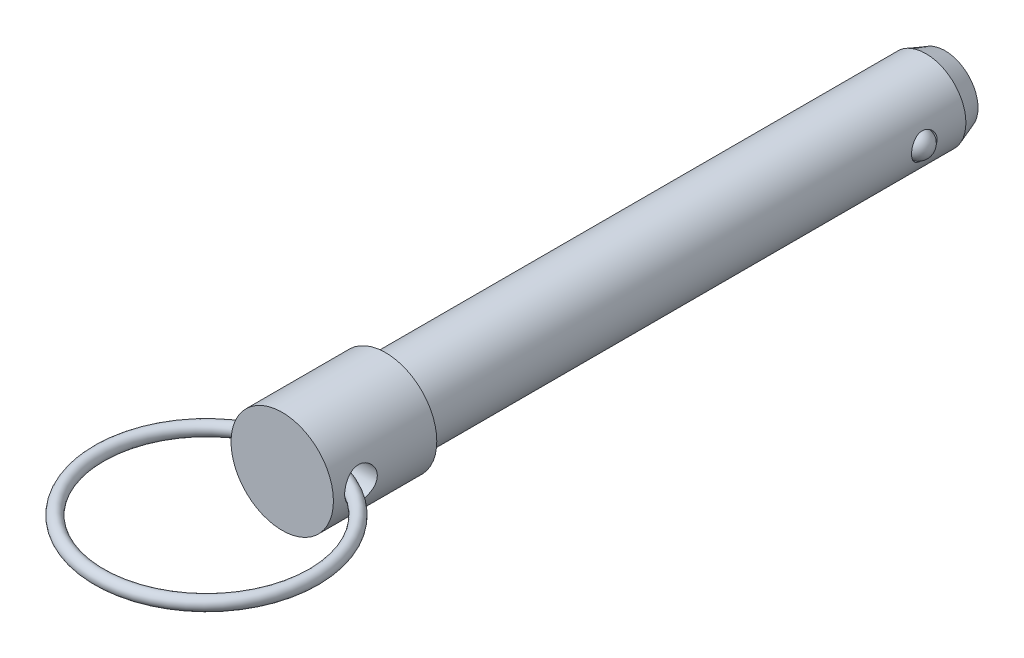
ISO-10303-21;
HEADER;
FILE_DESCRIPTION(('STEP AP214'),'2;1');
FILE_NAME('part.step','',(''),(''),'','','');
FILE_SCHEMA(('AUTOMOTIVE_DESIGN { 1 0 10303 214 1 1 1 1 }'));
ENDSEC;
DATA;
#1=APPLICATION_CONTEXT('core data for automotive mechanical design processes');
#2=APPLICATION_PROTOCOL_DEFINITION('international standard','automotive_design',2000,#1);
#3=PRODUCT_CONTEXT('',#1,'mechanical');
#4=PRODUCT('Part','Part','',(#3));
#5=PRODUCT_RELATED_PRODUCT_CATEGORY('part','',(#4));
#6=PRODUCT_DEFINITION_FORMATION('','',#4);
#7=PRODUCT_DEFINITION_CONTEXT('part definition',#1,'design');
#8=PRODUCT_DEFINITION('design','',#6,#7);
#9=PRODUCT_DEFINITION_SHAPE('','',#8);
#10=(LENGTH_UNIT() NAMED_UNIT(*) SI_UNIT(.MILLI.,.METRE.));
#11=(NAMED_UNIT(*) PLANE_ANGLE_UNIT() SI_UNIT($,.RADIAN.));
#12=(NAMED_UNIT(*) SI_UNIT($,.STERADIAN.) SOLID_ANGLE_UNIT());
#13=UNCERTAINTY_MEASURE_WITH_UNIT(LENGTH_MEASURE(1.E-05),#10,'distance_accuracy_value','');
#14=(GEOMETRIC_REPRESENTATION_CONTEXT(3) GLOBAL_UNCERTAINTY_ASSIGNED_CONTEXT((#13)) GLOBAL_UNIT_ASSIGNED_CONTEXT((#10,
#11,#12)) REPRESENTATION_CONTEXT('',''));
#15=CARTESIAN_POINT('',(0.,0.,0.));
#16=DIRECTION('',(0.,0.,1.));
#17=DIRECTION('',(1.,0.,0.));
#18=AXIS2_PLACEMENT_3D('',#15,#16,#17);
#19=CARTESIAN_POINT('',(7.9375,0.,9.398));
#20=DIRECTION('',(-1.,0.,0.));
#21=DIRECTION('',(0.,0.,-1.));
#22=AXIS2_PLACEMENT_3D('',#19,#20,#21);
#23=CYLINDRICAL_SURFACE('',#22,2.0193);
#24=CARTESIAN_POINT('',(-6.3502,0.292157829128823,11.3960531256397));
#25=CARTESIAN_POINT('',(-6.33446408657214,0.262361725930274,11.4004344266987));
#26=CARTESIAN_POINT('',(-6.32102794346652,0.231225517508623,11.4042829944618));
#27=CARTESIAN_POINT('',(-6.2992523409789,0.167152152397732,11.4106204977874));
#28=CARTESIAN_POINT('',(-6.29090461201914,0.134218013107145,11.413111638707));
#29=CARTESIAN_POINT('',(-6.2797291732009,0.0672091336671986,11.4164621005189));
#30=CARTESIAN_POINT('',(-6.27692077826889,0.0331308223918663,11.4173157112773));
#31=CARTESIAN_POINT('',(-6.27702601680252,-0.0350157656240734,11.4172838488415));
#32=CARTESIAN_POINT('',(-6.27993956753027,-0.0690840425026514,11.4163984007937));
#33=CARTESIAN_POINT('',(-6.29126629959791,-0.135748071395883,11.4130038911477));
#34=CARTESIAN_POINT('',(-6.2996097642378,-0.168356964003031,11.4105154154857));
#35=CARTESIAN_POINT('',(-6.32127848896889,-0.231802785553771,11.404211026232));
#36=CARTESIAN_POINT('',(-6.33461136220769,-0.262636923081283,11.4003930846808));
#37=CARTESIAN_POINT('',(-6.3502,-0.292157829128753,11.3960531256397));
#38=B_SPLINE_CURVE_WITH_KNOTS('',3,(#24,#25,#26,#27,#28,#29,#30,#31,#32,#33,#34,#35,#36,#37),
.UNSPECIFIED.,.F.,.F.,(4,2,2,2,2,2,4),(0.,0.101899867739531,0.203633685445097,0.305721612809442,
0.407808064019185,0.508608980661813,0.609564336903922),.UNSPECIFIED.);
#39=CARTESIAN_POINT('',(-6.3438349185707,0.2797472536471,11.3978284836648));
#40=VERTEX_POINT('',#39);
#41=CARTESIAN_POINT('',(-6.34383491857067,-0.279747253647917,11.3978284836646));
#42=VERTEX_POINT('',#41);
#43=EDGE_CURVE('E40',#40,#42,#38,.T.);
#44=ORIENTED_EDGE('',*,*,#43,.F.);
#45=CARTESIAN_POINT('',(-6.35,0.,11.4173));
#46=CARTESIAN_POINT('',(-6.34999578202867,-0.110312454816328,11.417293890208));
#47=CARTESIAN_POINT('',(-6.34709412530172,-0.220741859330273,11.4082188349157));
#48=CARTESIAN_POINT('',(-6.3357852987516,-0.438477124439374,11.3722159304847));
#49=CARTESIAN_POINT('',(-6.3273687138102,-0.545777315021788,11.3452575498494));
#50=CARTESIAN_POINT('',(-6.30595235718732,-0.753914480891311,11.2744960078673));
#51=CARTESIAN_POINT('',(-6.29296259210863,-0.85476500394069,11.2307296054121));
#52=CARTESIAN_POINT('',(-6.26374009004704,-1.04765917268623,11.1277235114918));
#53=CARTESIAN_POINT('',(-6.24750783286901,-1.13970411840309,11.0684861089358));
#54=CARTESIAN_POINT('',(-6.2129360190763,-1.31536123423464,10.9342184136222));
#55=CARTESIAN_POINT('',(-6.19454917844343,-1.39865352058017,10.8587818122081));
#56=CARTESIAN_POINT('',(-6.15801023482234,-1.55164747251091,10.6951184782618));
#57=CARTESIAN_POINT('',(-6.13985819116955,-1.62134576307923,10.606888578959));
#58=CARTESIAN_POINT('',(-6.1053372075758,-1.74691684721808,10.4173629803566));
#59=CARTESIAN_POINT('',(-6.08902613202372,-1.80238797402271,10.315789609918));
#60=CARTESIAN_POINT('',(-6.06074349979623,-1.89532725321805,10.104153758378));
#61=CARTESIAN_POINT('',(-6.04877073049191,-1.93280043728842,9.99409365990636));
#62=CARTESIAN_POINT('',(-6.03101341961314,-1.9875076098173,9.77220930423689));
#63=CARTESIAN_POINT('',(-6.0250482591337,-2.00533395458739,9.66054596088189));
#64=CARTESIAN_POINT('',(-6.01944581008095,-2.02209234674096,9.43566621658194));
#65=CARTESIAN_POINT('',(-6.01980677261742,-2.02102961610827,9.32245025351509));
#66=CARTESIAN_POINT('',(-6.02665663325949,-2.0005025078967,9.10261826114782));
#67=CARTESIAN_POINT('',(-6.03289303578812,-1.98179631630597,8.99592223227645));
#68=CARTESIAN_POINT('',(-6.05038018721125,-1.92774435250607,8.78726894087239));
#69=CARTESIAN_POINT('',(-6.06163151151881,-1.89239667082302,8.68531222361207));
#70=CARTESIAN_POINT('',(-6.08807105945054,-1.80553890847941,8.48724541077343));
#71=CARTESIAN_POINT('',(-6.1033159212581,-1.75379385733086,8.39124624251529));
#72=CARTESIAN_POINT('',(-6.13599834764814,-1.63577635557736,8.20905256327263));
#73=CARTESIAN_POINT('',(-6.15343637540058,-1.56950083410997,8.12286013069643));
#74=CARTESIAN_POINT('',(-6.18954615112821,-1.42061516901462,7.95845350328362));
#75=CARTESIAN_POINT('',(-6.20823733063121,-1.33738288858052,7.88080597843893));
#76=CARTESIAN_POINT('',(-6.2440320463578,-1.15881168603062,7.74040227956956));
#77=CARTESIAN_POINT('',(-6.26113489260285,-1.06346754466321,7.67765255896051));
#78=CARTESIAN_POINT('',(-6.29201953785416,-0.862230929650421,7.56842117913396));
#79=CARTESIAN_POINT('',(-6.30576997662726,-0.756251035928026,7.5220914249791));
#80=CARTESIAN_POINT('',(-6.32815272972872,-0.537579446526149,7.448167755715));
#81=CARTESIAN_POINT('',(-6.3367955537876,-0.42490206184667,7.4205353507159));
#82=CARTESIAN_POINT('',(-6.34491251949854,-0.259333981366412,7.39474486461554));
#83=CARTESIAN_POINT('',(-6.3468148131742,-0.207677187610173,7.38873516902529));
#84=CARTESIAN_POINT('',(-6.34935954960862,-0.104022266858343,7.38071129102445));
#85=CARTESIAN_POINT('',(-6.35000198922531,-0.0520241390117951,7.37869711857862));
#86=CARTESIAN_POINT('',(-6.34999578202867,0.110312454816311,7.37870610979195));
#87=CARTESIAN_POINT('',(-6.34709412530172,0.220741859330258,7.38778116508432));
#88=CARTESIAN_POINT('',(-6.33578529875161,0.438477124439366,7.4237840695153));
#89=CARTESIAN_POINT('',(-6.32736871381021,0.545777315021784,7.45074245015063));
#90=CARTESIAN_POINT('',(-6.30595235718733,0.753914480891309,7.52150399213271));
#91=CARTESIAN_POINT('',(-6.29296259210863,0.854765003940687,7.56527039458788));
#92=CARTESIAN_POINT('',(-6.26374009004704,1.04765917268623,7.66827648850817));
#93=CARTESIAN_POINT('',(-6.24750783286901,1.13970411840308,7.72751389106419));
#94=CARTESIAN_POINT('',(-6.2129360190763,1.31536123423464,7.86178158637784));
#95=CARTESIAN_POINT('',(-6.19454917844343,1.39865352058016,7.93721818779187));
#96=CARTESIAN_POINT('',(-6.15801023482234,1.55164747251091,8.10088152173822));
#97=CARTESIAN_POINT('',(-6.13985819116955,1.62134576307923,8.18911142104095));
#98=CARTESIAN_POINT('',(-6.1053372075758,1.74691684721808,8.37863701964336));
#99=CARTESIAN_POINT('',(-6.08902613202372,1.80238797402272,8.48021039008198));
#100=CARTESIAN_POINT('',(-6.06074349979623,1.89532725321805,8.69184624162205));
#101=CARTESIAN_POINT('',(-6.04877073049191,1.93280043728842,8.80190634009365));
#102=CARTESIAN_POINT('',(-6.03101341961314,1.9875076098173,9.02379069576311));
#103=CARTESIAN_POINT('',(-6.0250482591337,2.00533395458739,9.13545403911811));
#104=CARTESIAN_POINT('',(-6.01944581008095,2.02209234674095,9.36033378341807));
#105=CARTESIAN_POINT('',(-6.01980677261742,2.02102961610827,9.47354974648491));
#106=CARTESIAN_POINT('',(-6.02665663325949,2.00050250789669,9.69338173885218));
#107=CARTESIAN_POINT('',(-6.03289303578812,1.98179631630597,9.80007776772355));
#108=CARTESIAN_POINT('',(-6.05038018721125,1.92774435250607,10.0087310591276));
#109=CARTESIAN_POINT('',(-6.06163151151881,1.89239667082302,10.1106877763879));
#110=CARTESIAN_POINT('',(-6.08807105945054,1.80553890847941,10.3087545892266));
#111=CARTESIAN_POINT('',(-6.1033159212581,1.75379385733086,10.4047537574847));
#112=CARTESIAN_POINT('',(-6.13599834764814,1.63577635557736,10.5869474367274));
#113=CARTESIAN_POINT('',(-6.15343637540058,1.56950083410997,10.6731398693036));
#114=CARTESIAN_POINT('',(-6.18954615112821,1.42061516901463,10.8375464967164));
#115=CARTESIAN_POINT('',(-6.20823733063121,1.33738288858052,10.9151940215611));
#116=CARTESIAN_POINT('',(-6.2440320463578,1.15881168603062,11.0555977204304));
#117=CARTESIAN_POINT('',(-6.26113489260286,1.06346754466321,11.1183474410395));
#118=CARTESIAN_POINT('',(-6.29201953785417,0.862230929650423,11.227578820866));
#119=CARTESIAN_POINT('',(-6.30576997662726,0.756251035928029,11.2739085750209));
#120=CARTESIAN_POINT('',(-6.32815272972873,0.53757944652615,11.347832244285));
#121=CARTESIAN_POINT('',(-6.33679555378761,0.424902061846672,11.3754646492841));
#122=CARTESIAN_POINT('',(-6.34491251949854,0.25933398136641,11.4012551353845));
#123=CARTESIAN_POINT('',(-6.34681481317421,0.207677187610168,11.4072648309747));
#124=CARTESIAN_POINT('',(-6.34935954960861,0.10402226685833,11.4152887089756));
#125=CARTESIAN_POINT('',(-6.35000198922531,0.0520241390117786,11.4173028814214));
#126=CARTESIAN_POINT('',(-6.35,0.,11.4173));
#127=B_SPLINE_CURVE_WITH_KNOTS('',3,(#45,#46,#47,#48,#49,#50,#51,#52,#53,#54,#55,#56,#57,#58,
#59,#60,#61,#62,#63,#64,#65,#66,#67,#68,#69,#70,#71,#72,#73,#74,#75,#76,#77,#78,#79,#80,#81,#82,
#83,#84,#85,#86,#87,#88,#89,#90,#91,#92,#93,#94,#95,#96,#97,#98,#99,#100,#101,#102,#103,#104,
#105,#106,#107,#108,#109,#110,#111,#112,#113,#114,#115,#116,#117,#118,#119,#120,#121,#122,#123,
#124,#125,#126),.UNSPECIFIED.,.T.,.F.,(4,2,2,2,2,2,2,2,2,2,2,2,2,2,2,2,2,2,2,2,2,2,2,2,2,2,2,2,
2,2,2,2,2,2,2,2,2,2,2,2,4),(0.,0.33073688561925,0.662039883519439,0.992622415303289,
1.32315606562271,1.66322530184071,2.00337886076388,2.35228054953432,2.70108463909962,
3.0390572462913,3.37693642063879,3.70092724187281,4.02495524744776,4.35385413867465,
4.68282260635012,5.02727904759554,5.37188442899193,5.71959937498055,6.06659632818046,
6.22257380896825,6.37855167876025,6.70928856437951,7.04059156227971,7.37117409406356,
7.70170774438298,8.04177698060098,8.38193053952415,8.73083222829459,9.0796363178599,
9.41760892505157,9.75548809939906,10.0794789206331,10.403506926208,10.7324058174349,
11.0613742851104,11.4058307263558,11.7504361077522,12.0981510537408,12.4451480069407,
12.6011254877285,12.7571033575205),.UNSPECIFIED.);
#128=EDGE_CURVE('E66',#42,#40,#127,.T.);
#129=ORIENTED_EDGE('',*,*,#128,.F.);
#130=EDGE_LOOP('',(#44,#129));
#131=FACE_BOUND('',#130,.T.);
#132=CARTESIAN_POINT('',(6.3502,-0.292157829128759,11.3960531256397));
#133=CARTESIAN_POINT('',(6.33446408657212,-0.262361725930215,11.4004344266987));
#134=CARTESIAN_POINT('',(6.32102794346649,-0.231225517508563,11.4042829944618));
#135=CARTESIAN_POINT('',(6.29925234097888,-0.167152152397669,11.4106204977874));
#136=CARTESIAN_POINT('',(6.29090461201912,-0.13421801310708,11.413111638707));
#137=CARTESIAN_POINT('',(6.27972917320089,-0.0672091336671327,11.4164621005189));
#138=CARTESIAN_POINT('',(6.27692077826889,-0.0331308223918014,11.4173157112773));
#139=CARTESIAN_POINT('',(6.27702601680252,0.0350157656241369,11.4172838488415));
#140=CARTESIAN_POINT('',(6.27993956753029,0.0690840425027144,11.4163984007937));
#141=CARTESIAN_POINT('',(6.29126629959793,0.135748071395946,11.4130038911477));
#142=CARTESIAN_POINT('',(6.29960976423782,0.168356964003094,11.4105154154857));
#143=CARTESIAN_POINT('',(6.3212784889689,0.231802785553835,11.4042110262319));
#144=CARTESIAN_POINT('',(6.3346113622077,0.262636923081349,11.4003930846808));
#145=CARTESIAN_POINT('',(6.3502,0.292157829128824,11.3960531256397));
#146=B_SPLINE_CURVE_WITH_KNOTS('',3,(#132,#133,#134,#135,#136,#137,#138,#139,#140,#141,#142,
#143,#144,#145),.UNSPECIFIED.,.F.,.F.,(4,2,2,2,2,2,4),(0.,0.101899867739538,0.203633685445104,
0.305721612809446,0.40780806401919,0.508608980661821,0.609564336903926),.UNSPECIFIED.);
#147=CARTESIAN_POINT('',(6.3438349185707,-0.279747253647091,11.3978284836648));
#148=VERTEX_POINT('',#147);
#149=CARTESIAN_POINT('',(6.34383491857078,0.279747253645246,11.397828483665));
#150=VERTEX_POINT('',#149);
#151=EDGE_CURVE('E33',#148,#150,#146,.T.);
#152=ORIENTED_EDGE('',*,*,#151,.F.);
#153=CARTESIAN_POINT('',(6.35,0.,7.3787));
#154=CARTESIAN_POINT('',(6.34999578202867,-0.110312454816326,7.37870610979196));
#155=CARTESIAN_POINT('',(6.34709412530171,-0.22074185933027,7.38778116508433));
#156=CARTESIAN_POINT('',(6.3357852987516,-0.438477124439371,7.4237840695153));
#157=CARTESIAN_POINT('',(6.32736871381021,-0.545777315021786,7.45074245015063));
#158=CARTESIAN_POINT('',(6.30595235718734,-0.753914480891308,7.52150399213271));
#159=CARTESIAN_POINT('',(6.29296259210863,-0.854765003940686,7.56527039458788));
#160=CARTESIAN_POINT('',(6.26374009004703,-1.04765917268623,7.66827648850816));
#161=CARTESIAN_POINT('',(6.247507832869,-1.13970411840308,7.72751389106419));
#162=CARTESIAN_POINT('',(6.21293601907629,-1.31536123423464,7.86178158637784));
#163=CARTESIAN_POINT('',(6.19454917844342,-1.39865352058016,7.93721818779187));
#164=CARTESIAN_POINT('',(6.15801023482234,-1.55164747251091,8.10088152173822));
#165=CARTESIAN_POINT('',(6.13985819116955,-1.62134576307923,8.18911142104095));
#166=CARTESIAN_POINT('',(6.1053372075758,-1.74691684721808,8.37863701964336));
#167=CARTESIAN_POINT('',(6.08902613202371,-1.80238797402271,8.48021039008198));
#168=CARTESIAN_POINT('',(6.06074349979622,-1.89532725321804,8.69184624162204));
#169=CARTESIAN_POINT('',(6.04877073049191,-1.93280043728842,8.80190634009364));
#170=CARTESIAN_POINT('',(6.03101341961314,-1.9875076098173,9.02379069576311));
#171=CARTESIAN_POINT('',(6.02504825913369,-2.00533395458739,9.13545403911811));
#172=CARTESIAN_POINT('',(6.01944581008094,-2.02209234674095,9.36033378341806));
#173=CARTESIAN_POINT('',(6.01980677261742,-2.02102961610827,9.47354974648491));
#174=CARTESIAN_POINT('',(6.02665663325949,-2.00050250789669,9.69338173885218));
#175=CARTESIAN_POINT('',(6.03289303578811,-1.98179631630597,9.80007776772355));
#176=CARTESIAN_POINT('',(6.05038018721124,-1.92774435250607,10.0087310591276));
#177=CARTESIAN_POINT('',(6.06163151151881,-1.89239667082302,10.1106877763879));
#178=CARTESIAN_POINT('',(6.08807105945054,-1.80553890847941,10.3087545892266));
#179=CARTESIAN_POINT('',(6.1033159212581,-1.75379385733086,10.4047537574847));
#180=CARTESIAN_POINT('',(6.13599834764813,-1.63577635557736,10.5869474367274));
#181=CARTESIAN_POINT('',(6.15343637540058,-1.56950083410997,10.6731398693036));
#182=CARTESIAN_POINT('',(6.18954615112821,-1.42061516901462,10.8375464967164));
#183=CARTESIAN_POINT('',(6.2082373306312,-1.33738288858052,10.9151940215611));
#184=CARTESIAN_POINT('',(6.24403204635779,-1.15881168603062,11.0555977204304));
#185=CARTESIAN_POINT('',(6.26113489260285,-1.06346754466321,11.1183474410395));
#186=CARTESIAN_POINT('',(6.29201953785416,-0.862230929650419,11.227578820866));
#187=CARTESIAN_POINT('',(6.30576997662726,-0.756251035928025,11.2739085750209));
#188=CARTESIAN_POINT('',(6.32815272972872,-0.537579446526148,11.347832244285));
#189=CARTESIAN_POINT('',(6.3367955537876,-0.424902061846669,11.3754646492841));
#190=CARTESIAN_POINT('',(6.34491251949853,-0.25933398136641,11.4012551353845));
#191=CARTESIAN_POINT('',(6.3468148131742,-0.207677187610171,11.4072648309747));
#192=CARTESIAN_POINT('',(6.34935954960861,-0.10402226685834,11.4152887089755));
#193=CARTESIAN_POINT('',(6.35000198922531,-0.0520241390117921,11.4173028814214));
#194=CARTESIAN_POINT('',(6.34999578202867,0.110312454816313,11.417293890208));
#195=CARTESIAN_POINT('',(6.34709412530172,0.220741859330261,11.4082188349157));
#196=CARTESIAN_POINT('',(6.33578529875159,0.438477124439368,11.3722159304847));
#197=CARTESIAN_POINT('',(6.3273687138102,0.545777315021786,11.3452575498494));
#198=CARTESIAN_POINT('',(6.30595235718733,0.753914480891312,11.2744960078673));
#199=CARTESIAN_POINT('',(6.29296259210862,0.854765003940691,11.2307296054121));
#200=CARTESIAN_POINT('',(6.26374009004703,1.04765917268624,11.1277235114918));
#201=CARTESIAN_POINT('',(6.247507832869,1.13970411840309,11.0684861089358));
#202=CARTESIAN_POINT('',(6.21293601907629,1.31536123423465,10.9342184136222));
#203=CARTESIAN_POINT('',(6.19454917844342,1.39865352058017,10.8587818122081));
#204=CARTESIAN_POINT('',(6.15801023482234,1.55164747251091,10.6951184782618));
#205=CARTESIAN_POINT('',(6.13985819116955,1.62134576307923,10.606888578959));
#206=CARTESIAN_POINT('',(6.1053372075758,1.74691684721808,10.4173629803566));
#207=CARTESIAN_POINT('',(6.08902613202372,1.80238797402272,10.315789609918));
#208=CARTESIAN_POINT('',(6.06074349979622,1.89532725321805,10.104153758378));
#209=CARTESIAN_POINT('',(6.0487707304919,1.93280043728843,9.99409365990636));
#210=CARTESIAN_POINT('',(6.03101341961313,1.9875076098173,9.77220930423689));
#211=CARTESIAN_POINT('',(6.02504825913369,2.0053339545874,9.66054596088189));
#212=CARTESIAN_POINT('',(6.01944581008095,2.02209234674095,9.43566621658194));
#213=CARTESIAN_POINT('',(6.01980677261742,2.02102961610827,9.32245025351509));
#214=CARTESIAN_POINT('',(6.02665663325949,2.00050250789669,9.10261826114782));
#215=CARTESIAN_POINT('',(6.03289303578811,1.98179631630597,8.99592223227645));
#216=CARTESIAN_POINT('',(6.05038018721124,1.92774435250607,8.78726894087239));
#217=CARTESIAN_POINT('',(6.06163151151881,1.89239667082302,8.68531222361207));
#218=CARTESIAN_POINT('',(6.08807105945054,1.80553890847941,8.48724541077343));
#219=CARTESIAN_POINT('',(6.1033159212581,1.75379385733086,8.39124624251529));
#220=CARTESIAN_POINT('',(6.13599834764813,1.63577635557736,8.20905256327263));
#221=CARTESIAN_POINT('',(6.15343637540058,1.56950083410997,8.12286013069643));
#222=CARTESIAN_POINT('',(6.18954615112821,1.42061516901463,7.95845350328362));
#223=CARTESIAN_POINT('',(6.2082373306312,1.33738288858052,7.88080597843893));
#224=CARTESIAN_POINT('',(6.24403204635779,1.15881168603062,7.74040227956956));
#225=CARTESIAN_POINT('',(6.26113489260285,1.06346754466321,7.67765255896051));
#226=CARTESIAN_POINT('',(6.29201953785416,0.862230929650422,7.56842117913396));
#227=CARTESIAN_POINT('',(6.30576997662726,0.756251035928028,7.5220914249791));
#228=CARTESIAN_POINT('',(6.32815272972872,0.53757944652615,7.448167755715));
#229=CARTESIAN_POINT('',(6.3367955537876,0.424902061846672,7.4205353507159));
#230=CARTESIAN_POINT('',(6.34491251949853,0.25933398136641,7.39474486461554));
#231=CARTESIAN_POINT('',(6.3468148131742,0.207677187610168,7.38873516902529));
#232=CARTESIAN_POINT('',(6.34935954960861,0.104022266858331,7.38071129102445));
#233=CARTESIAN_POINT('',(6.35000198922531,0.0520241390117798,7.37869711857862));
#234=CARTESIAN_POINT('',(6.35,0.,7.3787));
#235=B_SPLINE_CURVE_WITH_KNOTS('',3,(#153,#154,#155,#156,#157,#158,#159,#160,#161,#162,#163,
#164,#165,#166,#167,#168,#169,#170,#171,#172,#173,#174,#175,#176,#177,#178,#179,#180,#181,#182,
#183,#184,#185,#186,#187,#188,#189,#190,#191,#192,#193,#194,#195,#196,#197,#198,#199,#200,#201,
#202,#203,#204,#205,#206,#207,#208,#209,#210,#211,#212,#213,#214,#215,#216,#217,#218,#219,#220,
#221,#222,#223,#224,#225,#226,#227,#228,#229,#230,#231,#232,#233,#234),.UNSPECIFIED.,.T.,.F.,(4,
2,2,2,2,2,2,2,2,2,2,2,2,2,2,2,2,2,2,2,2,2,2,2,2,2,2,2,2,2,2,2,2,2,2,2,2,2,2,2,4),(0.,
0.330736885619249,0.662039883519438,0.992622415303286,1.32315606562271,1.66322530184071,
2.00337886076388,2.35228054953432,2.70108463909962,3.0390572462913,3.37693642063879,
3.7009272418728,4.02495524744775,4.35385413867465,4.68282260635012,5.02727904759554,
5.37188442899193,5.71959937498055,6.06659632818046,6.22257380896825,6.37855167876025,
6.70928856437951,7.04059156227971,7.37117409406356,7.70170774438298,8.04177698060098,
8.38193053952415,8.73083222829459,9.07963631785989,9.41760892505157,9.75548809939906,
10.0794789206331,10.403506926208,10.7324058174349,11.0613742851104,11.4058307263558,
11.7504361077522,12.0981510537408,12.4451480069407,12.6011254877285,12.7571033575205),.UNSPECIFIED.);
#236=EDGE_CURVE('E62',#150,#148,#235,.T.);
#237=ORIENTED_EDGE('',*,*,#236,.F.);
#238=EDGE_LOOP('',(#152,#237));
#239=FACE_BOUND('',#238,.T.);
#240=ADVANCED_FACE('F14',(#131,#239),#23,.F.);
#241=CARTESIAN_POINT('',(0.,0.,-34.39922));
#242=DIRECTION('',(0.,0.,-1.));
#243=DIRECTION('',(1.,0.,0.));
#244=AXIS2_PLACEMENT_3D('',#241,#242,#243);
#245=CYLINDRICAL_SURFACE('',#244,6.35);
#246=ORIENTED_EDGE('',*,*,#236,.T.);
#247=CARTESIAN_POINT('',(6.34911067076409,-0.106292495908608,9.64531337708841));
#248=CARTESIAN_POINT('',(6.3483941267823,-0.149074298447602,9.65137725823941));
#249=CARTESIAN_POINT('',(6.34724965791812,-0.191344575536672,9.66110939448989));
#250=CARTESIAN_POINT('',(6.34423605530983,-0.273618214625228,9.68758101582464));
#251=CARTESIAN_POINT('',(6.34236646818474,-0.3136201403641,9.704324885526));
#252=CARTESIAN_POINT('',(6.3381174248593,-0.39017545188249,9.74421775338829));
#253=CARTESIAN_POINT('',(6.33573876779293,-0.42673411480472,9.76735672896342));
#254=CARTESIAN_POINT('',(6.33072830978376,-0.495552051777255,9.8192835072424));
#255=CARTESIAN_POINT('',(6.32809652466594,-0.527811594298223,9.84807095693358));
#256=CARTESIAN_POINT('',(6.32277775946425,-0.588154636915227,9.91124388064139));
#257=CARTESIAN_POINT('',(6.32009122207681,-0.616100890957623,9.94576018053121));
#258=CARTESIAN_POINT('',(6.31500218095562,-0.666246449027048,10.0187508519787));
#259=CARTESIAN_POINT('',(6.31259974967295,-0.688444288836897,10.0572262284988));
#260=CARTESIAN_POINT('',(6.30814194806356,-0.728200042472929,10.1398945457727));
#261=CARTESIAN_POINT('',(6.30612298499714,-0.745320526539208,10.1842993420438));
#262=CARTESIAN_POINT('',(6.30283333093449,-0.772645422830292,10.2752074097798));
#263=CARTESIAN_POINT('',(6.30156294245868,-0.782847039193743,10.3217115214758));
#264=CARTESIAN_POINT('',(6.2997729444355,-0.797132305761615,10.4203656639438));
#265=CARTESIAN_POINT('',(6.29934001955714,-0.800511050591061,10.4726191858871));
#266=CARTESIAN_POINT('',(6.29948539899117,-0.799363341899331,10.5770343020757));
#267=CARTESIAN_POINT('',(6.30006412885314,-0.79483356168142,10.6291958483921));
#268=CARTESIAN_POINT('',(6.30224519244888,-0.777362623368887,10.7373900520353));
#269=CARTESIAN_POINT('',(6.30394321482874,-0.763632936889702,10.7932945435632));
#270=CARTESIAN_POINT('',(6.3082304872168,-0.727364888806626,10.9021925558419));
#271=CARTESIAN_POINT('',(6.31082057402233,-0.704818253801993,10.9551832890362));
#272=CARTESIAN_POINT('',(6.31668084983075,-0.65024958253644,11.058462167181));
#273=CARTESIAN_POINT('',(6.31997188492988,-0.617920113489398,11.108588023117));
#274=CARTESIAN_POINT('',(6.32672369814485,-0.54444422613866,11.2018715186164));
#275=CARTESIAN_POINT('',(6.33018413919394,-0.503314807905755,11.2450423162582));
#276=CARTESIAN_POINT('',(6.33576833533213,-0.426106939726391,11.3105875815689));
#277=CARTESIAN_POINT('',(6.3379874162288,-0.392058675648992,11.3353540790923));
#278=CARTESIAN_POINT('',(6.34201635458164,-0.320334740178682,11.378985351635));
#279=CARTESIAN_POINT('',(6.34382654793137,-0.282662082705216,11.3978549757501));
#280=CARTESIAN_POINT('',(6.34683709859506,-0.204222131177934,11.4286907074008));
#281=CARTESIAN_POINT('',(6.34803303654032,-0.16343477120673,11.4406068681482));
#282=CARTESIAN_POINT('',(6.34962760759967,-0.0803154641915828,11.456409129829));
#283=CARTESIAN_POINT('',(6.35002678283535,-0.0379845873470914,11.4603006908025));
#284=CARTESIAN_POINT('',(6.34997361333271,0.0416311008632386,11.4597766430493));
#285=CARTESIAN_POINT('',(6.34961570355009,0.0789250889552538,11.4562823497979));
#286=CARTESIAN_POINT('',(6.34827799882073,0.152365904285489,11.4430416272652));
#287=CARTESIAN_POINT('',(6.34729819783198,0.188512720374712,11.4332951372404));
#288=CARTESIAN_POINT('',(6.34483463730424,0.258437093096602,11.4082426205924));
#289=CARTESIAN_POINT('',(6.34335520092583,0.292232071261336,11.392984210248));
#290=CARTESIAN_POINT('',(6.3400309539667,0.357164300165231,11.3576448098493));
#291=CARTESIAN_POINT('',(6.33818602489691,0.388300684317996,11.3375622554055));
#292=CARTESIAN_POINT('',(6.33403341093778,0.451264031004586,11.2905464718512));
#293=CARTESIAN_POINT('',(6.33169671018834,0.482680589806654,11.2630681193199));
#294=CARTESIAN_POINT('',(6.32695276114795,0.541327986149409,11.2039742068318));
#295=CARTESIAN_POINT('',(6.32454547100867,0.568556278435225,11.1723561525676));
#296=CARTESIAN_POINT('',(6.31940966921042,0.623257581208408,11.0997303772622));
#297=CARTESIAN_POINT('',(6.31670324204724,0.649859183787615,11.0580641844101));
#298=CARTESIAN_POINT('',(6.31169900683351,0.696787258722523,10.9713122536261));
#299=CARTESIAN_POINT('',(6.30940147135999,0.717109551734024,10.9262242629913));
#300=CARTESIAN_POINT('',(6.30511939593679,0.753900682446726,10.8265682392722));
#301=CARTESIAN_POINT('',(6.30323580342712,0.769311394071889,10.7716021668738));
#302=CARTESIAN_POINT('',(6.30052520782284,0.791204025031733,10.6598731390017));
#303=CARTESIAN_POINT('',(6.2996986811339,0.797681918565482,10.6031093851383));
#304=CARTESIAN_POINT('',(6.29923241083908,0.801360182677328,10.4867557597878));
#305=CARTESIAN_POINT('',(6.2996462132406,0.798141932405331,10.4271509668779));
#306=CARTESIAN_POINT('',(6.30178827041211,0.781050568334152,10.3094933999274));
#307=CARTESIAN_POINT('',(6.30351599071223,0.767181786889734,10.2514400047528));
#308=CARTESIAN_POINT('',(6.30793273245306,0.7299366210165,10.1430301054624));
#309=CARTESIAN_POINT('',(6.31054579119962,0.707295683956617,10.0924193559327));
#310=CARTESIAN_POINT('',(6.316412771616,0.652821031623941,9.99644731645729));
#311=CARTESIAN_POINT('',(6.31966615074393,0.620995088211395,9.95108163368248));
#312=CARTESIAN_POINT('',(6.3259599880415,0.55295430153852,9.87232840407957));
#313=CARTESIAN_POINT('',(6.32898344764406,0.517631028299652,9.83816824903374));
#314=CARTESIAN_POINT('',(6.33476504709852,0.441261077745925,9.77694761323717));
#315=CARTESIAN_POINT('',(6.33752330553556,0.400216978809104,9.74988394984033));
#316=CARTESIAN_POINT('',(6.34218417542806,0.317440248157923,9.70596453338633));
#317=CARTESIAN_POINT('',(6.34413984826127,0.276067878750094,9.68843287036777));
#318=CARTESIAN_POINT('',(6.34727291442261,0.190881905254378,9.66089843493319));
#319=CARTESIAN_POINT('',(6.34845102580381,0.147070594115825,9.65088871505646));
#320=CARTESIAN_POINT('',(6.34972965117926,0.0681015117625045,9.64007587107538));
#321=CARTESIAN_POINT('',(6.35000959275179,0.0331486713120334,9.63773711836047));
#322=CARTESIAN_POINT('',(6.34998989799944,-0.0367451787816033,9.63790342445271));
#323=CARTESIAN_POINT('',(6.34969028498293,-0.0716861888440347,9.64040828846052));
#324=CARTESIAN_POINT('',(6.34911067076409,-0.106292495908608,9.64531337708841));
#325=B_SPLINE_CURVE_WITH_KNOTS('',3,(#247,#248,#249,#250,#251,#252,#253,#254,#255,#256,#257,
#258,#259,#260,#261,#262,#263,#264,#265,#266,#267,#268,#269,#270,#271,#272,#273,#274,#275,#276,
#277,#278,#279,#280,#281,#282,#283,#284,#285,#286,#287,#288,#289,#290,#291,#292,#293,#294,#295,
#296,#297,#298,#299,#300,#301,#302,#303,#304,#305,#306,#307,#308,#309,#310,#311,#312,#313,#314,
#315,#316,#317,#318,#319,#320,#321,#322,#323,#324),.UNSPECIFIED.,.T.,.F.,(4,2,2,2,2,2,2,2,2,2,2,
2,2,2,2,2,2,2,2,2,2,2,2,2,2,2,2,2,2,2,2,2,2,2,2,2,2,2,4),(0.,0.129515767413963,
0.259112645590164,0.388507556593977,0.517894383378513,0.650795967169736,0.783731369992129,
0.926038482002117,1.06840306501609,1.22484845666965,1.38135967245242,1.55336962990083,
1.72554138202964,1.90381365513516,2.08174459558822,2.2077364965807,2.33362451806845,
2.4604060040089,2.58710119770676,2.6989276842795,2.81075525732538,2.92163901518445,
3.03255877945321,3.15750232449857,3.28252150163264,3.43047497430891,3.57852670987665,
3.74912471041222,3.91979957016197,4.09794717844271,4.27602235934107,4.44160182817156,
4.60704160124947,4.75394079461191,4.90077399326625,5.03502725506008,5.1691563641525,
5.27392620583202,5.37869183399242),.UNSPECIFIED.);
#326=EDGE_CURVE('E27',#148,#150,#325,.T.);
#327=ORIENTED_EDGE('',*,*,#326,.T.);
#328=EDGE_LOOP('',(#246,#327));
#329=FACE_BOUND('',#328,.T.);
#330=CARTESIAN_POINT('',(0.,0.,12.8270000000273));
#331=DIRECTION('',(0.,0.,-1.));
#332=DIRECTION('',(1.,0.,0.));
#333=AXIS2_PLACEMENT_3D('',#330,#331,#332);
#334=CIRCLE('',#333,6.34999999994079);
#335=CARTESIAN_POINT('',(6.34999999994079,0.,12.8270000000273));
#336=VERTEX_POINT('',#335);
#337=EDGE_CURVE('E70',#336,#336,#334,.T.);
#338=ORIENTED_EDGE('',*,*,#337,.T.);
#339=EDGE_LOOP('',(#338));
#340=FACE_BOUND('',#339,.T.);
#341=CARTESIAN_POINT('',(0.,0.,1.16018306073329E-11));
#342=DIRECTION('',(0.,0.,-1.));
#343=DIRECTION('',(1.,0.,0.));
#344=AXIS2_PLACEMENT_3D('',#341,#342,#343);
#345=CIRCLE('',#344,6.34999999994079);
#346=CARTESIAN_POINT('',(6.34999999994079,0.,1.16015507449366E-11));
#347=VERTEX_POINT('',#346);
#348=EDGE_CURVE('E60',#347,#347,#345,.T.);
#349=ORIENTED_EDGE('',*,*,#348,.F.);
#350=EDGE_LOOP('',(#349));
#351=FACE_BOUND('',#350,.T.);
#352=ORIENTED_EDGE('',*,*,#128,.T.);
#353=CARTESIAN_POINT('',(-6.3491106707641,-0.106292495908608,9.64531337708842));
#354=CARTESIAN_POINT('',(-6.34981427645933,-0.0642492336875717,9.63935614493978));
#355=CARTESIAN_POINT('',(-6.35010491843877,-0.0216882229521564,9.63693832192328));
#356=CARTESIAN_POINT('',(-6.34982708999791,0.0632451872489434,9.63926820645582));
#357=CARTESIAN_POINT('',(-6.34925830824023,0.105617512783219,9.64401851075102));
#358=CARTESIAN_POINT('',(-6.3473255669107,0.188929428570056,9.66052387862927));
#359=CARTESIAN_POINT('',(-6.34596206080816,0.22986982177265,9.67227494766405));
#360=CARTESIAN_POINT('',(-6.34259173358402,0.309205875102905,9.7023861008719));
#361=CARTESIAN_POINT('',(-6.34058494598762,0.347601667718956,9.72074584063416));
#362=CARTESIAN_POINT('',(-6.33612262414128,0.421219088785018,9.76368889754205));
#363=CARTESIAN_POINT('',(-6.33366281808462,0.456405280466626,9.78833239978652));
#364=CARTESIAN_POINT('',(-6.3285674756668,0.522330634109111,9.84295801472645));
#365=CARTESIAN_POINT('',(-6.32593191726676,0.553069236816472,9.87294079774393));
#366=CARTESIAN_POINT('',(-6.32063739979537,0.610668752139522,9.93869049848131));
#367=CARTESIAN_POINT('',(-6.31798210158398,0.637312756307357,9.97464737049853));
#368=CARTESIAN_POINT('',(-6.31302530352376,0.684675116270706,10.050284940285));
#369=CARTESIAN_POINT('',(-6.31072390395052,0.705391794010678,10.0899666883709));
#370=CARTESIAN_POINT('',(-6.3065253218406,0.742027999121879,10.1750481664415));
#371=CARTESIAN_POINT('',(-6.30467116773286,0.757473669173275,10.2206536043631));
#372=CARTESIAN_POINT('',(-6.30176158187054,0.781309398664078,10.3136897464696));
#373=CARTESIAN_POINT('',(-6.30070647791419,0.789696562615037,10.3611211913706));
#374=CARTESIAN_POINT('',(-6.29939708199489,0.800080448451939,10.4615517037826));
#375=CARTESIAN_POINT('',(-6.29923479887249,0.80134327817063,10.5146278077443));
#376=CARTESIAN_POINT('',(-6.29993274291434,0.795834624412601,10.6203535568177));
#377=CARTESIAN_POINT('',(-6.30079341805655,0.789059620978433,10.6730030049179));
#378=CARTESIAN_POINT('',(-6.30354435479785,0.76679085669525,10.7816321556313));
#379=CARTESIAN_POINT('',(-6.3055245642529,0.75053077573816,10.8374538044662));
#380=CARTESIAN_POINT('',(-6.3103170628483,0.709106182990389,10.9457204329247));
#381=CARTESIAN_POINT('',(-6.31313013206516,0.683933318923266,10.9981621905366));
#382=CARTESIAN_POINT('',(-6.31930287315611,0.624362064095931,11.0989766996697));
#383=CARTESIAN_POINT('',(-6.32267249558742,0.589786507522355,11.1472450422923));
#384=CARTESIAN_POINT('',(-6.32944316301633,0.512016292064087,11.2362287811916));
#385=CARTESIAN_POINT('',(-6.33284412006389,0.468841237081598,11.2769609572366));
#386=CARTESIAN_POINT('',(-6.3381447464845,0.389210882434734,11.3371705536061));
#387=CARTESIAN_POINT('',(-6.34018413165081,0.354783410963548,11.3593300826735));
#388=CARTESIAN_POINT('',(-6.34380499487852,0.282727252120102,11.3976985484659));
#389=CARTESIAN_POINT('',(-6.34538687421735,0.245101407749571,11.4139127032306));
#390=CARTESIAN_POINT('',(-6.34791613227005,0.16728046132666,11.4394899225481));
#391=CARTESIAN_POINT('',(-6.34885950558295,0.127070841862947,11.4488097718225));
#392=CARTESIAN_POINT('',(-6.34996657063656,0.0456031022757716,11.459723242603));
#393=CARTESIAN_POINT('',(-6.35013061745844,0.00434546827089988,11.4613203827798));
#394=CARTESIAN_POINT('',(-6.34968170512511,-0.0735082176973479,11.4569121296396));
#395=CARTESIAN_POINT('',(-6.34914631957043,-0.110150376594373,11.4516658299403));
#396=CARTESIAN_POINT('',(-6.34749195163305,-0.182042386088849,11.4351966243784));
#397=CARTESIAN_POINT('',(-6.3463729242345,-0.217292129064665,11.4239732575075));
#398=CARTESIAN_POINT('',(-6.34364878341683,-0.286046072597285,11.3959879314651));
#399=CARTESIAN_POINT('',(-6.34203717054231,-0.31951944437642,11.379151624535));
#400=CARTESIAN_POINT('',(-6.33848327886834,-0.383617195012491,11.3407750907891));
#401=CARTESIAN_POINT('',(-6.336540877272,-0.414240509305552,11.3192331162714));
#402=CARTESIAN_POINT('',(-6.33219640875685,-0.476327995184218,11.2689534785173));
#403=CARTESIAN_POINT('',(-6.32976799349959,-0.507315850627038,11.2396315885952));
#404=CARTESIAN_POINT('',(-6.32489282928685,-0.564859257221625,11.1769313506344));
#405=CARTESIAN_POINT('',(-6.32244606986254,-0.591412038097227,11.1435504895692));
#406=CARTESIAN_POINT('',(-6.31728331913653,-0.644412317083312,11.0671373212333));
#407=CARTESIAN_POINT('',(-6.31460099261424,-0.669935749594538,11.0234608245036));
#408=CARTESIAN_POINT('',(-6.3097291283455,-0.714365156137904,10.9328329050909));
#409=CARTESIAN_POINT('',(-6.30753991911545,-0.733266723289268,10.8858793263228));
#410=CARTESIAN_POINT('',(-6.30360262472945,-0.766429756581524,10.7829444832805));
#411=CARTESIAN_POINT('',(-6.30196031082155,-0.779660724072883,10.7266239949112));
#412=CARTESIAN_POINT('',(-6.29981098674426,-0.796841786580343,10.6125408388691));
#413=CARTESIAN_POINT('',(-6.29930438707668,-0.800788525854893,10.5547776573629));
#414=CARTESIAN_POINT('',(-6.29954116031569,-0.798927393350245,10.4378617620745));
#415=CARTESIAN_POINT('',(-6.30031766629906,-0.792860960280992,10.3787123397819));
#416=CARTESIAN_POINT('',(-6.3031448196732,-0.770063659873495,10.2625195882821));
#417=CARTESIAN_POINT('',(-6.30519479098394,-0.753338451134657,10.2054751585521));
#418=CARTESIAN_POINT('',(-6.31011127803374,-0.710921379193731,10.100203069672));
#419=CARTESIAN_POINT('',(-6.31289804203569,-0.686067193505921,10.0516355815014));
#420=CARTESIAN_POINT('',(-6.31897863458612,-0.627588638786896,9.96012359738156));
#421=CARTESIAN_POINT('',(-6.32227210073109,-0.59397052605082,9.91717512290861));
#422=CARTESIAN_POINT('',(-6.32851172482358,-0.523028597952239,9.84320836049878));
#423=CARTESIAN_POINT('',(-6.33145578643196,-0.486532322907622,9.81139456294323));
#424=CARTESIAN_POINT('',(-6.33697928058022,-0.408315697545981,9.75500457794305));
#425=CARTESIAN_POINT('',(-6.33955910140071,-0.366601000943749,9.73042065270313));
#426=CARTESIAN_POINT('',(-6.34352567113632,-0.288721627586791,9.69390061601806));
#427=CARTESIAN_POINT('',(-6.34504971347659,-0.253297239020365,9.68038073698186));
#428=CARTESIAN_POINT('',(-6.34752864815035,-0.18081626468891,9.65874203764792));
#429=CARTESIAN_POINT('',(-6.34848364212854,-0.143759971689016,9.65062225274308));
#430=CARTESIAN_POINT('',(-6.3491106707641,-0.106292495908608,9.64531337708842));
#431=B_SPLINE_CURVE_WITH_KNOTS('',3,(#353,#354,#355,#356,#357,#358,#359,#360,#361,#362,#363,
#364,#365,#366,#367,#368,#369,#370,#371,#372,#373,#374,#375,#376,#377,#378,#379,#380,#381,#382,
#383,#384,#385,#386,#387,#388,#389,#390,#391,#392,#393,#394,#395,#396,#397,#398,#399,#400,#401,
#402,#403,#404,#405,#406,#407,#408,#409,#410,#411,#412,#413,#414,#415,#416,#417,#418,#419,#420,
#421,#422,#423,#424,#425,#426,#427,#428,#429,#430),.UNSPECIFIED.,.T.,.F.,(4,2,2,2,2,2,2,2,2,2,2,
2,2,2,2,2,2,2,2,2,2,2,2,2,2,2,2,2,2,2,2,2,2,2,2,2,2,2,4),(0.,0.127270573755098,
0.254587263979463,0.38183137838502,0.50906886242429,0.637574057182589,0.766095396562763,
0.900011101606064,1.03396468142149,1.17792305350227,1.32194045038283,1.48055524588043,
1.63923952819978,1.81298136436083,1.98688644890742,2.16432734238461,2.34136826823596,
2.46386496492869,2.58625389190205,2.70940363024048,2.83249725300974,2.94303106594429,
3.05357340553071,3.16564234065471,3.27775296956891,3.40546920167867,3.53326491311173,
3.6846489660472,3.83613357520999,4.00898453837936,4.18189796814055,4.35934661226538,
4.53670112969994,4.69966495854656,4.86251276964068,5.00725534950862,5.15184244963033,
5.26528177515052,5.3787008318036),.UNSPECIFIED.);
#432=EDGE_CURVE('E9',#40,#42,#431,.T.);
#433=ORIENTED_EDGE('',*,*,#432,.T.);
#434=EDGE_LOOP('',(#352,#433));
#435=FACE_BOUND('',#434,.T.);
#436=ADVANCED_FACE('F64',(#329,#340,#351,#435),#245,.T.);
#437=CARTESIAN_POINT('',(0.,0.,0.));
#438=DIRECTION('',(0.,0.,-1.));
#439=DIRECTION('',(-1.,0.,0.));
#440=AXIS2_PLACEMENT_3D('',#437,#438,#439);
#441=PLANE('',#440);
#442=ORIENTED_EDGE('',*,*,#348,.T.);
#443=EDGE_LOOP('',(#442));
#444=FACE_BOUND('',#443,.T.);
#445=CARTESIAN_POINT('',(0.,0.,-1.11299858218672E-11));
#446=DIRECTION('',(0.,0.,-1.));
#447=DIRECTION('',(-1.,0.,0.));
#448=AXIS2_PLACEMENT_3D('',#445,#446,#447);
#449=CIRCLE('',#448,4.95554);
#450=CARTESIAN_POINT('',(-4.95554,0.,-1.11305926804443E-11));
#451=VERTEX_POINT('',#450);
#452=EDGE_CURVE('E67',#451,#451,#449,.T.);
#453=ORIENTED_EDGE('',*,*,#452,.F.);
#454=EDGE_LOOP('',(#453));
#455=FACE_BOUND('',#454,.T.);
#456=ADVANCED_FACE('F16',(#444,#455),#441,.T.);
#457=CARTESIAN_POINT('',(0.,-6.096,12.827));
#458=DIRECTION('',(0.,0.,1.));
#459=DIRECTION('',(-1.,0.,0.));
#460=AXIS2_PLACEMENT_3D('',#457,#458,#459);
#461=PLANE('',#460);
#462=ORIENTED_EDGE('',*,*,#337,.F.);
#463=EDGE_LOOP('',(#462));
#464=FACE_BOUND('',#463,.T.);
#465=ADVANCED_FACE('F183',(#464),#461,.T.);
#466=CARTESIAN_POINT('',(0.,7.24262754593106E-11,499940.60078));
#467=DIRECTION('',(0.,0.,-1.));
#468=DIRECTION('',(-1.,0.,0.));
#469=AXIS2_PLACEMENT_3D('',#466,#467,#468);
#470=CYLINDRICAL_SURFACE('',#469,4.95554);
#471=ORIENTED_EDGE('',*,*,#452,.T.);
#472=EDGE_LOOP('',(#471));
#473=FACE_BOUND('',#472,.T.);
#474=CARTESIAN_POINT('',(4.95554,0.,-60.29332));
#475=CARTESIAN_POINT('',(4.95553666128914,0.0866897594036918,-60.2933248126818));
#476=CARTESIAN_POINT('',(4.95324045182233,0.173471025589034,-60.3004537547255));
#477=CARTESIAN_POINT('',(4.9442912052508,0.344577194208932,-60.3287349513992));
#478=CARTESIAN_POINT('',(4.9376307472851,0.428897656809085,-60.349911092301));
#479=CARTESIAN_POINT('',(4.92068254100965,0.592457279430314,-60.4054922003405));
#480=CARTESIAN_POINT('',(4.9104027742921,0.671707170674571,-60.4398680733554));
#481=CARTESIAN_POINT('',(4.88727518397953,0.823288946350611,-60.5207700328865));
#482=CARTESIAN_POINT('',(4.87442773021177,0.895621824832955,-60.5672943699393));
#483=CARTESIAN_POINT('',(4.84705629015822,1.03369400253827,-60.6727644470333));
#484=CARTESIAN_POINT('',(4.83249427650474,1.09917878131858,-60.7320335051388));
#485=CARTESIAN_POINT('',(4.80355063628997,1.21947281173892,-60.860625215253));
#486=CARTESIAN_POINT('',(4.78916905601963,1.27427937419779,-60.9299503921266));
#487=CARTESIAN_POINT('',(4.76180578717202,1.37305673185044,-61.0789084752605));
#488=CARTESIAN_POINT('',(4.74887057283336,1.41670648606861,-61.1587636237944));
#489=CARTESIAN_POINT('',(4.72643603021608,1.48985016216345,-61.3251622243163));
#490=CARTESIAN_POINT('',(4.71693572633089,1.51934810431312,-61.4117037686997));
#491=CARTESIAN_POINT('',(4.70284355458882,1.56241523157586,-61.5861508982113));
#492=CARTESIAN_POINT('',(4.69810668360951,1.57645629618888,-61.6739279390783));
#493=CARTESIAN_POINT('',(4.69364777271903,1.58968567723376,-61.8507099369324));
#494=CARTESIAN_POINT('',(4.69392432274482,1.58887816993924,-61.9397145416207));
#495=CARTESIAN_POINT('',(4.6993333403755,1.5728014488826,-62.1124771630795));
#496=CARTESIAN_POINT('',(4.70426240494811,1.55813797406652,-62.1962990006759));
#497=CARTESIAN_POINT('',(4.71808978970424,1.51574977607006,-62.3602240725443));
#498=CARTESIAN_POINT('',(4.72698857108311,1.4880235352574,-62.4403268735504));
#499=CARTESIAN_POINT('',(4.74790477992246,1.41987997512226,-62.5959596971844));
#500=CARTESIAN_POINT('',(4.75996755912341,1.37927613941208,-62.6714016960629));
#501=CARTESIAN_POINT('',(4.78583160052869,1.286661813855,-62.8145932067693));
#502=CARTESIAN_POINT('',(4.79963323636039,1.234648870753,-62.8823410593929));
#503=CARTESIAN_POINT('',(4.82822844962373,1.11775274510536,-63.0116328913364));
#504=CARTESIAN_POINT('',(4.84303789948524,1.05237301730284,-63.0727252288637));
#505=CARTESIAN_POINT('',(4.87140539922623,0.912085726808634,-63.1832136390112));
#506=CARTESIAN_POINT('',(4.88496290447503,0.837174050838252,-63.2326046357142));
#507=CARTESIAN_POINT('',(4.90945634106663,0.679024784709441,-63.3186171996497));
#508=CARTESIAN_POINT('',(4.92036685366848,0.59571656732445,-63.3551163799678));
#509=CARTESIAN_POINT('',(4.93813643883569,0.423802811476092,-63.4133833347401));
#510=CARTESIAN_POINT('',(4.94500382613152,0.335208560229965,-63.435181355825));
#511=CARTESIAN_POINT('',(4.95147275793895,0.204839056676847,-63.4555865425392));
#512=CARTESIAN_POINT('',(4.95299354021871,0.164038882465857,-63.4603558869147));
#513=CARTESIAN_POINT('',(4.95502795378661,0.0821659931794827,-63.4667237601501));
#514=CARTESIAN_POINT('',(4.95554158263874,0.0410932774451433,-63.4683222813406));
#515=CARTESIAN_POINT('',(4.95553666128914,-0.0866897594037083,-63.4683151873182));
#516=CARTESIAN_POINT('',(4.95324045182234,-0.173471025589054,-63.4611862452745));
#517=CARTESIAN_POINT('',(4.9442912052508,-0.344577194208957,-63.4329050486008));
#518=CARTESIAN_POINT('',(4.9376307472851,-0.428897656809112,-63.4117289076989));
#519=CARTESIAN_POINT('',(4.92068254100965,-0.592457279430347,-63.3561477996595));
#520=CARTESIAN_POINT('',(4.9104027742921,-0.67170717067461,-63.3217719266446));
#521=CARTESIAN_POINT('',(4.88727518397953,-0.823288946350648,-63.2408699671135));
#522=CARTESIAN_POINT('',(4.87442773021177,-0.895621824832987,-63.1943456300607));
#523=CARTESIAN_POINT('',(4.84705629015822,-1.0336940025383,-63.0888755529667));
#524=CARTESIAN_POINT('',(4.83249427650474,-1.09917878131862,-63.0296064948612));
#525=CARTESIAN_POINT('',(4.80355063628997,-1.21947281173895,-62.901014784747));
#526=CARTESIAN_POINT('',(4.78916905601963,-1.27427937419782,-62.8316896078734));
#527=CARTESIAN_POINT('',(4.76180578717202,-1.37305673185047,-62.6827315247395));
#528=CARTESIAN_POINT('',(4.74887057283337,-1.41670648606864,-62.6028763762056));
#529=CARTESIAN_POINT('',(4.72643603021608,-1.48985016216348,-62.4364777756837));
#530=CARTESIAN_POINT('',(4.71693572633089,-1.51934810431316,-62.3499362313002));
#531=CARTESIAN_POINT('',(4.70284355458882,-1.56241523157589,-62.1754891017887));
#532=CARTESIAN_POINT('',(4.69810668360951,-1.57645629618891,-62.0877120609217));
#533=CARTESIAN_POINT('',(4.69364777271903,-1.58968567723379,-61.9109300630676));
#534=CARTESIAN_POINT('',(4.69392432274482,-1.58887816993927,-61.8219254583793));
#535=CARTESIAN_POINT('',(4.6993333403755,-1.57280144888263,-61.6491628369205));
#536=CARTESIAN_POINT('',(4.70426240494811,-1.55813797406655,-61.5653409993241));
#537=CARTESIAN_POINT('',(4.71808978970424,-1.5157497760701,-61.4014159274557));
#538=CARTESIAN_POINT('',(4.72698857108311,-1.48802353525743,-61.3213131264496));
#539=CARTESIAN_POINT('',(4.74790477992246,-1.41987997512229,-61.1656803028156));
#540=CARTESIAN_POINT('',(4.7599675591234,-1.37927613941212,-61.0902383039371));
#541=CARTESIAN_POINT('',(4.78583160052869,-1.28666181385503,-60.9470467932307));
#542=CARTESIAN_POINT('',(4.79963323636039,-1.23464887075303,-60.8792989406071));
#543=CARTESIAN_POINT('',(4.82822844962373,-1.11775274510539,-60.7500071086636));
#544=CARTESIAN_POINT('',(4.84303789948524,-1.05237301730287,-60.6889147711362));
#545=CARTESIAN_POINT('',(4.87140539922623,-0.912085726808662,-60.5784263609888));
#546=CARTESIAN_POINT('',(4.88496290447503,-0.837174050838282,-60.5290353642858));
#547=CARTESIAN_POINT('',(4.90945634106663,-0.679024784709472,-60.4430228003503));
#548=CARTESIAN_POINT('',(4.92036685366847,-0.595716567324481,-60.4065236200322));
#549=CARTESIAN_POINT('',(4.93813643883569,-0.423802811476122,-60.3482566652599));
#550=CARTESIAN_POINT('',(4.94500382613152,-0.335208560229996,-60.326458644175));
#551=CARTESIAN_POINT('',(4.95147275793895,-0.204839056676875,-60.3060534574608));
#552=CARTESIAN_POINT('',(4.95299354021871,-0.164038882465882,-60.3012841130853));
#553=CARTESIAN_POINT('',(4.95502795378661,-0.082165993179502,-60.2949162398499));
#554=CARTESIAN_POINT('',(4.95554158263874,-0.0410932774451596,-60.2933177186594));
#555=CARTESIAN_POINT('',(4.95554,0.,-60.29332));
#556=B_SPLINE_CURVE_WITH_KNOTS('',3,(#474,#475,#476,#477,#478,#479,#480,#481,#482,#483,#484,
#485,#486,#487,#488,#489,#490,#491,#492,#493,#494,#495,#496,#497,#498,#499,#500,#501,#502,#503,
#504,#505,#506,#507,#508,#509,#510,#511,#512,#513,#514,#515,#516,#517,#518,#519,#520,#521,#522,
#523,#524,#525,#526,#527,#528,#529,#530,#531,#532,#533,#534,#535,#536,#537,#538,#539,#540,#541,
#542,#543,#544,#545,#546,#547,#548,#549,#550,#551,#552,#553,#554,#555),.UNSPECIFIED.,.T.,.F.,(4,
2,2,2,2,2,2,2,2,2,2,2,2,2,2,2,2,2,2,2,2,2,2,2,2,2,2,2,2,2,2,2,2,2,2,2,2,2,2,2,4),(0.,
0.259910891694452,0.52026488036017,0.780048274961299,1.03979427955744,1.30713240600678,
1.57453777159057,1.84893984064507,2.12326391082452,2.38895860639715,2.65457857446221,
2.90909875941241,3.16364852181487,3.42206782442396,3.68054274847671,3.9513789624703,
4.22233244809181,4.49579311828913,4.76868943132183,4.89189388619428,5.01509863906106,
5.27500953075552,5.53536351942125,5.79514691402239,6.05489291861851,6.32223104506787,
6.58963641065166,6.86403847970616,7.1383625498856,7.40405724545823,7.66967721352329,
7.92419739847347,8.17874716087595,8.43716646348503,8.69564138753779,8.96647760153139,
9.23743108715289,9.5108917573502,9.78378807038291,9.90699252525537,10.0301972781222),.UNSPECIFIED.);
#557=CARTESIAN_POINT('',(4.95554,0.,-60.29332));
#558=VERTEX_POINT('',#557);
#559=EDGE_CURVE('E135',#558,#558,#556,.T.);
#560=ORIENTED_EDGE('',*,*,#559,.T.);
#561=EDGE_LOOP('',(#560));
#562=FACE_BOUND('',#561,.T.);
#563=CARTESIAN_POINT('',(0.,0.,-67.03702));
#564=DIRECTION('',(0.,0.,-1.));
#565=DIRECTION('',(-1.,0.,0.));
#566=AXIS2_PLACEMENT_3D('',#563,#564,#565);
#567=CIRCLE('',#566,4.95554);
#568=CARTESIAN_POINT('',(-4.95553999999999,0.,-67.03702));
#569=VERTEX_POINT('',#568);
#570=EDGE_CURVE('E121',#569,#569,#567,.F.);
#571=ORIENTED_EDGE('',*,*,#570,.T.);
#572=EDGE_LOOP('',(#571));
#573=FACE_BOUND('',#572,.T.);
#574=CARTESIAN_POINT('',(-4.95554,0.,-63.46832));
#575=CARTESIAN_POINT('',(-4.95553666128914,0.0866897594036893,-63.4683151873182));
#576=CARTESIAN_POINT('',(-4.95324045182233,0.173471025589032,-63.4611862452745));
#577=CARTESIAN_POINT('',(-4.94429120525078,0.34457719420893,-63.4329050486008));
#578=CARTESIAN_POINT('',(-4.93763074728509,0.428897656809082,-63.4117289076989));
#579=CARTESIAN_POINT('',(-4.92068254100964,0.592457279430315,-63.3561477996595));
#580=CARTESIAN_POINT('',(-4.91040277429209,0.671707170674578,-63.3217719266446));
#581=CARTESIAN_POINT('',(-4.88727518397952,0.823288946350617,-63.2408699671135));
#582=CARTESIAN_POINT('',(-4.87442773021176,0.895621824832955,-63.1943456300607));
#583=CARTESIAN_POINT('',(-4.84705629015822,1.03369400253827,-63.0888755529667));
#584=CARTESIAN_POINT('',(-4.83249427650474,1.09917878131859,-63.0296064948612));
#585=CARTESIAN_POINT('',(-4.80355063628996,1.21947281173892,-62.901014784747));
#586=CARTESIAN_POINT('',(-4.78916905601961,1.27427937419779,-62.8316896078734));
#587=CARTESIAN_POINT('',(-4.761805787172,1.37305673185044,-62.6827315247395));
#588=CARTESIAN_POINT('',(-4.74887057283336,1.41670648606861,-62.6028763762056));
#589=CARTESIAN_POINT('',(-4.72643603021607,1.48985016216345,-62.4364777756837));
#590=CARTESIAN_POINT('',(-4.71693572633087,1.51934810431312,-62.3499362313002));
#591=CARTESIAN_POINT('',(-4.7028435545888,1.56241523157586,-62.1754891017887));
#592=CARTESIAN_POINT('',(-4.6981066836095,1.57645629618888,-62.0877120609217));
#593=CARTESIAN_POINT('',(-4.69364777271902,1.58968567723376,-61.9109300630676));
#594=CARTESIAN_POINT('',(-4.69392432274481,1.58887816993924,-61.8219254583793));
#595=CARTESIAN_POINT('',(-4.69933334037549,1.5728014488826,-61.6491628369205));
#596=CARTESIAN_POINT('',(-4.7042624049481,1.55813797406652,-61.5653409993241));
#597=CARTESIAN_POINT('',(-4.71808978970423,1.51574977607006,-61.4014159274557));
#598=CARTESIAN_POINT('',(-4.72698857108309,1.48802353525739,-61.3213131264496));
#599=CARTESIAN_POINT('',(-4.74790477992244,1.41987997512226,-61.1656803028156));
#600=CARTESIAN_POINT('',(-4.75996755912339,1.37927613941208,-61.0902383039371));
#601=CARTESIAN_POINT('',(-4.78583160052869,1.286661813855,-60.9470467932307));
#602=CARTESIAN_POINT('',(-4.79963323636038,1.234648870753,-60.8792989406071));
#603=CARTESIAN_POINT('',(-4.82822844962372,1.11775274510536,-60.7500071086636));
#604=CARTESIAN_POINT('',(-4.84303789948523,1.05237301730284,-60.6889147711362));
#605=CARTESIAN_POINT('',(-4.87140539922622,0.912085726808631,-60.5784263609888));
#606=CARTESIAN_POINT('',(-4.88496290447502,0.83717405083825,-60.5290353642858));
#607=CARTESIAN_POINT('',(-4.90945634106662,0.67902478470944,-60.4430228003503));
#608=CARTESIAN_POINT('',(-4.92036685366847,0.595716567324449,-60.4065236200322));
#609=CARTESIAN_POINT('',(-4.93813643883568,0.423802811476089,-60.3482566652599));
#610=CARTESIAN_POINT('',(-4.94500382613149,0.335208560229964,-60.3264586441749));
#611=CARTESIAN_POINT('',(-4.95147275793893,0.204839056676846,-60.3060534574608));
#612=CARTESIAN_POINT('',(-4.9529935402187,0.164038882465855,-60.3012841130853));
#613=CARTESIAN_POINT('',(-4.9550279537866,0.0821659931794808,-60.2949162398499));
#614=CARTESIAN_POINT('',(-4.95554158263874,0.0410932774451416,-60.2933177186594));
#615=CARTESIAN_POINT('',(-4.95553666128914,-0.086689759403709,-60.2933248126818));
#616=CARTESIAN_POINT('',(-4.95324045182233,-0.173471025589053,-60.3004537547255));
#617=CARTESIAN_POINT('',(-4.94429120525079,-0.344577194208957,-60.3287349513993));
#618=CARTESIAN_POINT('',(-4.93763074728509,-0.428897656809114,-60.349911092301));
#619=CARTESIAN_POINT('',(-4.92068254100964,-0.592457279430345,-60.4054922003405));
#620=CARTESIAN_POINT('',(-4.91040277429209,-0.671707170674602,-60.4398680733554));
#621=CARTESIAN_POINT('',(-4.88727518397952,-0.823288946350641,-60.5207700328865));
#622=CARTESIAN_POINT('',(-4.87442773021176,-0.895621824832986,-60.5672943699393));
#623=CARTESIAN_POINT('',(-4.84705629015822,-1.0336940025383,-60.6727644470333));
#624=CARTESIAN_POINT('',(-4.83249427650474,-1.09917878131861,-60.7320335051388));
#625=CARTESIAN_POINT('',(-4.80355063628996,-1.21947281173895,-60.860625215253));
#626=CARTESIAN_POINT('',(-4.78916905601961,-1.27427937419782,-60.9299503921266));
#627=CARTESIAN_POINT('',(-4.76180578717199,-1.37305673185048,-61.0789084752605));
#628=CARTESIAN_POINT('',(-4.74887057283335,-1.41670648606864,-61.1587636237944));
#629=CARTESIAN_POINT('',(-4.72643603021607,-1.48985016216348,-61.3251622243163));
#630=CARTESIAN_POINT('',(-4.71693572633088,-1.51934810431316,-61.4117037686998));
#631=CARTESIAN_POINT('',(-4.70284355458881,-1.56241523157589,-61.5861508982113));
#632=CARTESIAN_POINT('',(-4.6981066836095,-1.57645629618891,-61.6739279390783));
#633=CARTESIAN_POINT('',(-4.69364777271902,-1.5896856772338,-61.8507099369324));
#634=CARTESIAN_POINT('',(-4.69392432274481,-1.58887816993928,-61.9397145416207));
#635=CARTESIAN_POINT('',(-4.69933334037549,-1.57280144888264,-62.1124771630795));
#636=CARTESIAN_POINT('',(-4.7042624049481,-1.55813797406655,-62.1962990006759));
#637=CARTESIAN_POINT('',(-4.71808978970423,-1.51574977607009,-62.3602240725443));
#638=CARTESIAN_POINT('',(-4.72698857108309,-1.48802353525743,-62.4403268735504));
#639=CARTESIAN_POINT('',(-4.74790477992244,-1.41987997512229,-62.5959596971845));
#640=CARTESIAN_POINT('',(-4.75996755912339,-1.37927613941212,-62.6714016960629));
#641=CARTESIAN_POINT('',(-4.78583160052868,-1.28666181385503,-62.8145932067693));
#642=CARTESIAN_POINT('',(-4.79963323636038,-1.23464887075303,-62.8823410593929));
#643=CARTESIAN_POINT('',(-4.82822844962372,-1.11775274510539,-63.0116328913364));
#644=CARTESIAN_POINT('',(-4.84303789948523,-1.05237301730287,-63.0727252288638));
#645=CARTESIAN_POINT('',(-4.87140539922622,-0.912085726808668,-63.1832136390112));
#646=CARTESIAN_POINT('',(-4.88496290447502,-0.837174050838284,-63.2326046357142));
#647=CARTESIAN_POINT('',(-4.90945634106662,-0.679024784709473,-63.3186171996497));
#648=CARTESIAN_POINT('',(-4.92036685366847,-0.595716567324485,-63.3551163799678));
#649=CARTESIAN_POINT('',(-4.93813643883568,-0.423802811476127,-63.4133833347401));
#650=CARTESIAN_POINT('',(-4.94500382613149,-0.335208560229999,-63.435181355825));
#651=CARTESIAN_POINT('',(-4.95147275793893,-0.204839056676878,-63.4555865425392));
#652=CARTESIAN_POINT('',(-4.9529935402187,-0.164038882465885,-63.4603558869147));
#653=CARTESIAN_POINT('',(-4.9550279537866,-0.0821659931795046,-63.4667237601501));
#654=CARTESIAN_POINT('',(-4.95554158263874,-0.0410932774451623,-63.4683222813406));
#655=CARTESIAN_POINT('',(-4.95554,0.,-63.46832));
#656=B_SPLINE_CURVE_WITH_KNOTS('',3,(#574,#575,#576,#577,#578,#579,#580,#581,#582,#583,#584,
#585,#586,#587,#588,#589,#590,#591,#592,#593,#594,#595,#596,#597,#598,#599,#600,#601,#602,#603,
#604,#605,#606,#607,#608,#609,#610,#611,#612,#613,#614,#615,#616,#617,#618,#619,#620,#621,#622,
#623,#624,#625,#626,#627,#628,#629,#630,#631,#632,#633,#634,#635,#636,#637,#638,#639,#640,#641,
#642,#643,#644,#645,#646,#647,#648,#649,#650,#651,#652,#653,#654,#655),.UNSPECIFIED.,.T.,.F.,(4,
2,2,2,2,2,2,2,2,2,2,2,2,2,2,2,2,2,2,2,2,2,2,2,2,2,2,2,2,2,2,2,2,2,2,2,2,2,2,2,4),(0.,
0.259910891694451,0.520264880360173,0.780048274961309,1.03979427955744,1.30713240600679,
1.57453777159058,1.84893984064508,2.12326391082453,2.38895860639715,2.65457857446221,
2.90909875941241,3.16364852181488,3.42206782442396,3.68054274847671,3.95137896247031,
4.22233244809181,4.49579311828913,4.76868943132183,4.89189388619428,5.01509863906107,
5.27500953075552,5.53536351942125,5.79514691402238,6.05489291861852,6.32223104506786,
6.58963641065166,6.86403847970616,7.13836254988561,7.40405724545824,7.66967721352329,
7.92419739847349,8.17874716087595,8.43716646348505,8.69564138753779,8.96647760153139,
9.2374310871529,9.51089175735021,9.78378807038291,9.90699252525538,10.0301972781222),.UNSPECIFIED.);
#657=CARTESIAN_POINT('',(-4.95554,0.,-63.46832));
#658=VERTEX_POINT('',#657);
#659=EDGE_CURVE('E73',#658,#658,#656,.T.);
#660=ORIENTED_EDGE('',*,*,#659,.T.);
#661=EDGE_LOOP('',(#660));
#662=FACE_BOUND('',#661,.T.);
#663=ADVANCED_FACE('F88',(#473,#562,#573,#662),#470,.T.);
#664=CARTESIAN_POINT('',(-4.2037,0.,-61.88082));
#665=DIRECTION('',(0.,0.,-1.));
#666=DIRECTION('',(1.,0.,0.));
#667=AXIS2_PLACEMENT_3D('',#664,#665,#666);
#668=SPHERICAL_SURFACE('',#667,1.5875);
#669=CARTESIAN_POINT('',(-4.2037,0.,-61.88082));
#670=DIRECTION('',(1.,0.,0.));
#671=DIRECTION('',(0.,0.,-1.));
#672=AXIS2_PLACEMENT_3D('',#669,#670,#671);
#673=CIRCLE('',#672,1.5875);
#674=CARTESIAN_POINT('',(-4.2037,0.,-63.46832));
#675=VERTEX_POINT('',#674);
#676=CARTESIAN_POINT('',(-4.2037,0.,-60.29332));
#677=VERTEX_POINT('',#676);
#678=EDGE_CURVE('E116',#675,#677,#673,.F.);
#679=ORIENTED_EDGE('',*,*,#678,.T.);
#680=CARTESIAN_POINT('',(-4.2037,0.,-61.88082));
#681=DIRECTION('',(1.,0.,0.));
#682=DIRECTION('',(0.,0.,-1.));
#683=AXIS2_PLACEMENT_3D('',#680,#681,#682);
#684=CIRCLE('',#683,1.5875);
#685=EDGE_CURVE('E142',#677,#675,#684,.F.);
#686=ORIENTED_EDGE('',*,*,#685,.T.);
#687=EDGE_LOOP('',(#679,#686));
#688=FACE_BOUND('',#687,.T.);
#689=ADVANCED_FACE('F100',(#688),#668,.T.);
#690=CARTESIAN_POINT('',(0.,0.,-69.39922));
#691=DIRECTION('',(0.,0.,-1.));
#692=DIRECTION('',(-1.,0.,0.));
#693=AXIS2_PLACEMENT_3D('',#690,#691,#692);
#694=PLANE('',#693);
#695=CARTESIAN_POINT('',(0.,0.,-69.3992200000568));
#696=DIRECTION('',(0.,0.,1.));
#697=DIRECTION('',(1.,0.,0.));
#698=AXIS2_PLACEMENT_3D('',#695,#696,#697);
#699=CIRCLE('',#698,4.0957695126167);
#700=CARTESIAN_POINT('',(4.09576951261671,0.,-69.3992200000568));
#701=VERTEX_POINT('',#700);
#702=EDGE_CURVE('E147',#701,#701,#699,.T.);
#703=ORIENTED_EDGE('',*,*,#702,.F.);
#704=EDGE_LOOP('',(#703));
#705=FACE_BOUND('',#704,.T.);
#706=ADVANCED_FACE('F126',(#705),#694,.T.);
#707=CARTESIAN_POINT('',(4.2037,0.,-61.88082));
#708=DIRECTION('',(0.,0.,1.));
#709=DIRECTION('',(1.,0.,0.));
#710=AXIS2_PLACEMENT_3D('',#707,#708,#709);
#711=SPHERICAL_SURFACE('',#710,1.5875);
#712=CARTESIAN_POINT('',(4.2037,0.,-61.88082));
#713=DIRECTION('',(1.,0.,0.));
#714=DIRECTION('',(0.,0.,-1.));
#715=AXIS2_PLACEMENT_3D('',#712,#713,#714);
#716=CIRCLE('',#715,1.5875);
#717=CARTESIAN_POINT('',(4.2037,0.,-63.46832));
#718=VERTEX_POINT('',#717);
#719=CARTESIAN_POINT('',(4.2037,0.,-60.29332));
#720=VERTEX_POINT('',#719);
#721=EDGE_CURVE('E256',#718,#720,#716,.T.);
#722=ORIENTED_EDGE('',*,*,#721,.T.);
#723=CARTESIAN_POINT('',(4.2037,0.,-61.88082));
#724=DIRECTION('',(1.,0.,0.));
#725=DIRECTION('',(0.,0.,-1.));
#726=AXIS2_PLACEMENT_3D('',#723,#724,#725);
#727=CIRCLE('',#726,1.5875);
#728=EDGE_CURVE('E258',#720,#718,#727,.T.);
#729=ORIENTED_EDGE('',*,*,#728,.T.);
#730=EDGE_LOOP('',(#722,#729));
#731=FACE_BOUND('',#730,.T.);
#732=ADVANCED_FACE('F101',(#731),#711,.T.);
#733=CARTESIAN_POINT('',(-6.35,0.,-61.88082));
#734=DIRECTION('',(1.,0.,0.));
#735=DIRECTION('',(0.,0.,-1.));
#736=AXIS2_PLACEMENT_3D('',#733,#734,#735);
#737=CYLINDRICAL_SURFACE('',#736,1.5875);
#738=ORIENTED_EDGE('',*,*,#659,.F.);
#739=EDGE_LOOP('',(#738));
#740=FACE_BOUND('',#739,.T.);
#741=ORIENTED_EDGE('',*,*,#678,.F.);
#742=ORIENTED_EDGE('',*,*,#685,.F.);
#743=EDGE_LOOP('',(#741,#742));
#744=FACE_BOUND('',#743,.T.);
#745=ADVANCED_FACE('F149',(#740,#744),#737,.F.);
#746=CARTESIAN_POINT('',(0.,0.,-67.0370200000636));
#747=DIRECTION('',(0.,0.,1.));
#748=DIRECTION('',(1.,0.,0.));
#749=AXIS2_PLACEMENT_3D('',#746,#747,#748);
#750=CONICAL_SURFACE('',#749,4.95553999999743,0.349065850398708);
#751=ORIENTED_EDGE('',*,*,#570,.F.);
#752=EDGE_LOOP('',(#751));
#753=FACE_BOUND('',#752,.T.);
#754=ORIENTED_EDGE('',*,*,#702,.T.);
#755=EDGE_LOOP('',(#754));
#756=FACE_BOUND('',#755,.T.);
#757=ADVANCED_FACE('F131',(#753,#756),#750,.T.);
#758=CARTESIAN_POINT('',(-6.35,0.,-61.88082));
#759=DIRECTION('',(1.,0.,0.));
#760=DIRECTION('',(0.,0.,-1.));
#761=AXIS2_PLACEMENT_3D('',#758,#759,#760);
#762=CYLINDRICAL_SURFACE('',#761,1.5875);
#763=ORIENTED_EDGE('',*,*,#721,.F.);
#764=ORIENTED_EDGE('',*,*,#728,.F.);
#765=EDGE_LOOP('',(#763,#764));
#766=FACE_BOUND('',#765,.T.);
#767=ORIENTED_EDGE('',*,*,#559,.F.);
#768=EDGE_LOOP('',(#767));
#769=FACE_BOUND('',#768,.T.);
#770=ADVANCED_FACE('F99',(#766,#769),#762,.F.);
#771=CARTESIAN_POINT('',(0.,0.,22.2270000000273));
#772=DIRECTION('',(0.,1.,0.));
#773=DIRECTION('',(0.,0.,1.));
#774=AXIS2_PLACEMENT_3D('',#771,#772,#773);
#775=TOROIDAL_SURFACE('',#774,13.3,0.8);
#776=ORIENTED_EDGE('',*,*,#326,.F.);
#777=ORIENTED_EDGE('',*,*,#151,.T.);
#778=EDGE_LOOP('',(#776,#777));
#779=FACE_BOUND('',#778,.T.);
#780=ORIENTED_EDGE('',*,*,#432,.F.);
#781=ORIENTED_EDGE('',*,*,#43,.T.);
#782=EDGE_LOOP('',(#780,#781));
#783=FACE_BOUND('',#782,.T.);
#784=ADVANCED_FACE('F56',(#779,#783),#775,.T.);
#785=CLOSED_SHELL('',(#240,#436,#456,#465,#663,#689,#706,#732,#745,#757,#770,#784));
#786=MANIFOLD_SOLID_BREP('B1',#785);
#787=ADVANCED_BREP_SHAPE_REPRESENTATION('',(#18,#786),#14);
#788=SHAPE_DEFINITION_REPRESENTATION(#9,#787);
ENDSEC;
END-ISO-10303-21;
